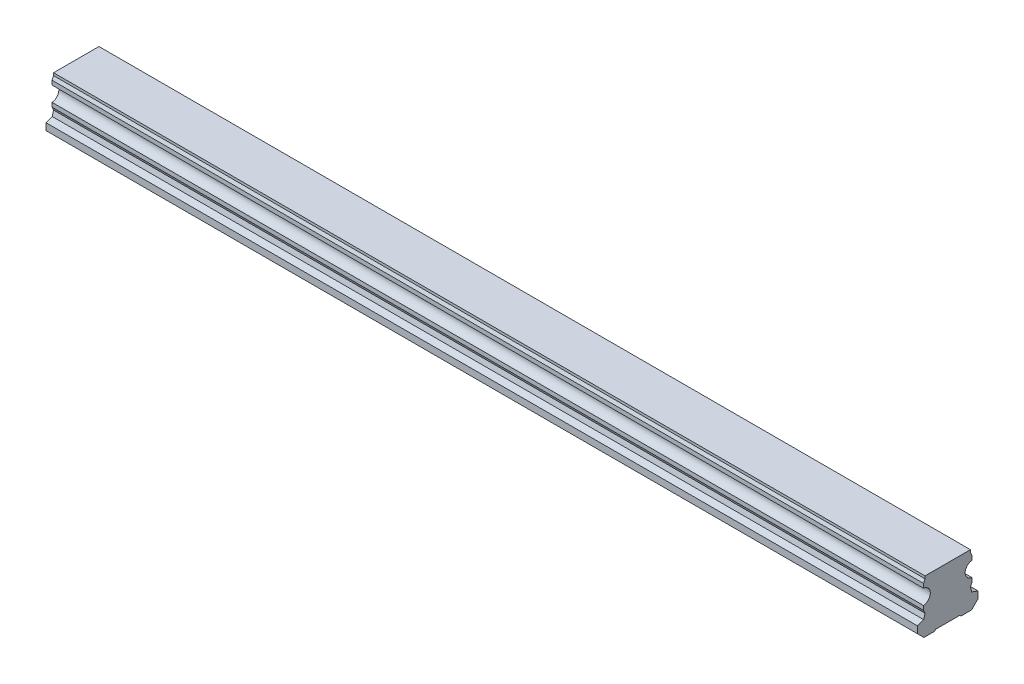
from build123d import *

# Parameters (mm, degrees)
BOSS_EXTRUDE1_DEPTH        = 360
SKETCH3_R                  = 3
SKETCH3_R_2                = 2.5
CUT_EXTRUDE3_DEPTH         = 12
SKETCH3_2_R                = 2.5
CUT_EXTRUDE4_DEPTH         = 15
CHAMFER1_SIZE              = 0.5
LPATTERN4_COUNT            = 6
LPATTERN4_PITCH            = 60
CHAMFER1_OF_LPATTERN4_SIZE = 0.5


with BuildPart() as part:
    # Sketch1 → Boss-Extrude1 (new body)
    with BuildSketch(Plane(origin=(0, 0, 0), x_dir=(0, 0, -1), z_dir=(1, 0, 0))):
        with BuildLine():
            Line((9.375, 21.8), (-9.375, 21.8))
            Line((-9.375, 21.8), (-9.375, 20.756))
            Line((-9.375, 20.756), (-10, 19.415683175))
            Line((-10, 19.415683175), (-10, 17.685449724))
            ThreePointArc((-10, 17.685449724), (-7.2, 14.6), (-10, 11.514550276))
            Line((-10, 11.514550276), (-10, 9.784316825))
            Line((-10, 9.784316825), (-9.375, 8.444))
            Line((-9.375, 8.444), (-9.922688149, 6.4))
            Line((-9.922688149, 6.4), (-12.5, 5.489338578))
            Line((-12.5, 5.489338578), (-12.5, 2.65))
            Line((-12.5, 2.65), (-9.85, 0))
            Line((-9.85, 0), (-5.5, 0))
            Line((-5.5, 0), (-5, 0.5))
            Line((-5, 0.5), (5, 0.5))
            Line((5, 0.5), (5.5, 0))
            Line((5.5, 0), (9.85, 0))
            Line((9.85, 0), (12.5, 2.65))
            Line((12.5, 2.65), (12.5, 5.489338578))
            Line((12.5, 5.489338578), (9.922688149, 6.4))
            Line((9.922688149, 6.4), (9.375, 8.444))
            Line((9.375, 8.444), (10, 9.784316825))
            Line((10, 9.784316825), (10, 11.514550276))
            ThreePointArc((10, 11.514550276), (7.2, 14.6), (10, 17.685449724))
            Line((10, 17.685449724), (10, 19.415683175))
            Line((10, 19.415683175), (9.375, 20.756))
            Line((9.375, 20.756), (9.375, 21.8))
        make_face()
    extrude(amount=BOSS_EXTRUDE1_DEPTH)

    # Sketch3 → Cut-Extrude3 (cut)
    with BuildSketch(Plane.XZ):
        with Locations(Location((30, 0, 0), (0, 0, 270))):
            Circle(SKETCH3_R)
        with Locations(Location((30, 0, 0), (0, 0, 270))):
            Circle(SKETCH3_R_2, mode=Mode.SUBTRACT)
    cut_extrude3 = extrude(amount=-CUT_EXTRUDE3_DEPTH, mode=Mode.SUBTRACT)

    # Sketch3_2 → Cut-Extrude4 (cut)
    with BuildSketch(Plane.XZ):
        with Locations(Location((30, 0, 0), (0, 0, 270))):
            Circle(SKETCH3_2_R)
    cut_extrude4 = extrude(amount=-CUT_EXTRUDE4_DEPTH, mode=Mode.SUBTRACT)

    # Cut-Extrude5 cone 1 section (on through the dimple's axis) → Cut-Extrude5 (revolve, cut)
    with BuildSketch(Plane(origin=(30, 15, 0), x_dir=(0, 0, -1), z_dir=(1, 0, 0))):
        Polygon((0, 0), (2.5, 0), (0, 1.443375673), align=None)
    cut_extrude5 = revolve(axis=Axis((30, 15, 0), (0, 1, 0)), mode=Mode.SUBTRACT)

    # Chamfer1
    chamfer1_edges = [part.edges().sort_by_distance(p)[0] for p in [
        (30, 0.5, 3),
    ]]
    chamfer(chamfer1_edges, length=CHAMFER1_SIZE)

    # LPattern4: Cut-Extrude3, Cut-Extrude4, Cut-Extrude5 ×6
    with Locations(*[(i * LPATTERN4_PITCH, 0, 0) for i in range(1, LPATTERN4_COUNT)]):
        add(cut_extrude3, mode=Mode.SUBTRACT)
        add(cut_extrude4, mode=Mode.SUBTRACT)
        add(cut_extrude5, mode=Mode.SUBTRACT)

    # Chamfer1 of LPattern4
    chamfer1_of_lpattern4_edges = [part.edges().sort_by_distance(p)[0] for p in [
        (90, 0.5, 3),
        (150, 0.5, 3),
        (210, 0.5, 3),
        (270, 0.5, 3),
        (330, 0.5, 3),
    ]]
    chamfer(chamfer1_of_lpattern4_edges, length=CHAMFER1_OF_LPATTERN4_SIZE)


solid = part.part
